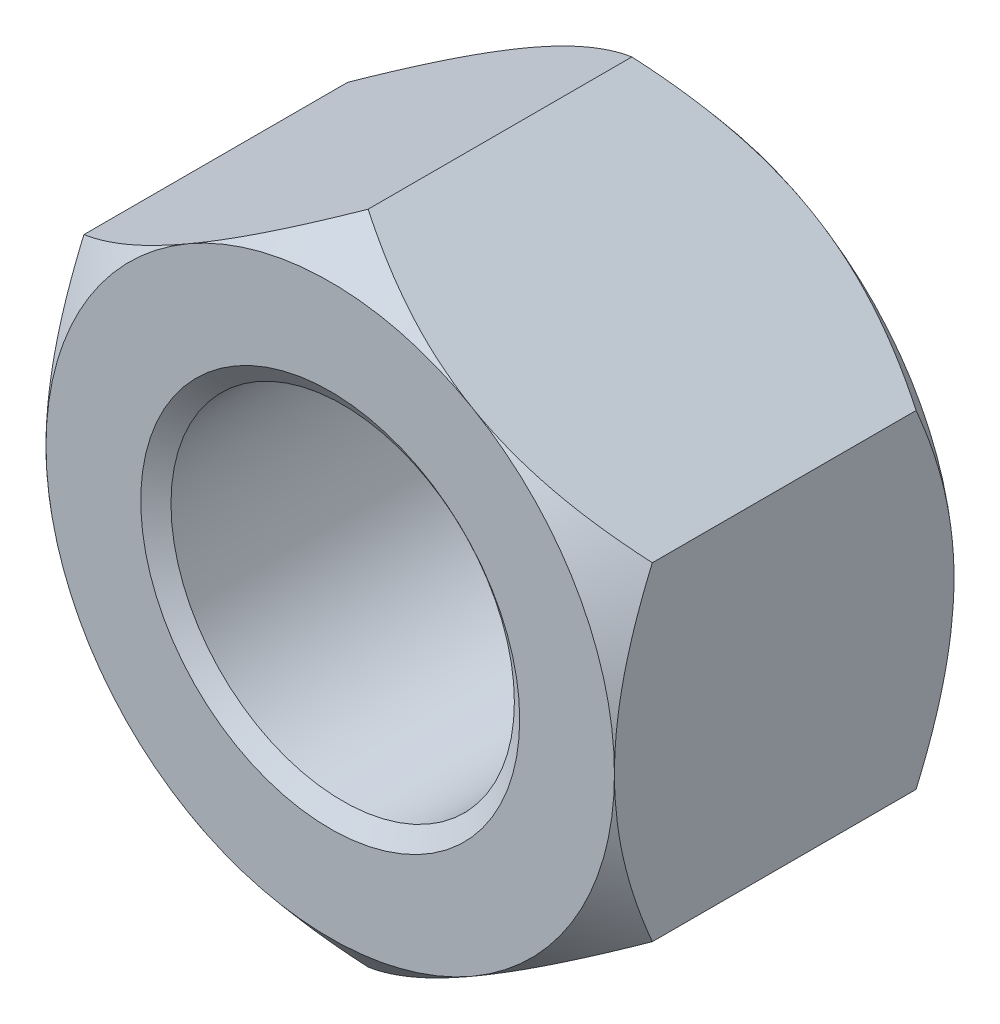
ISO-10303-21;
HEADER;
FILE_DESCRIPTION(('STEP AP214'),'2;1');
FILE_NAME('part.step','',(''),(''),'','','');
FILE_SCHEMA(('AUTOMOTIVE_DESIGN { 1 0 10303 214 1 1 1 1 }'));
ENDSEC;
DATA;
#1=APPLICATION_CONTEXT('core data for automotive mechanical design processes');
#2=APPLICATION_PROTOCOL_DEFINITION('international standard','automotive_design',2000,#1);
#3=PRODUCT_CONTEXT('',#1,'mechanical');
#4=PRODUCT('Part','Part','',(#3));
#5=PRODUCT_RELATED_PRODUCT_CATEGORY('part','',(#4));
#6=PRODUCT_DEFINITION_FORMATION('','',#4);
#7=PRODUCT_DEFINITION_CONTEXT('part definition',#1,'design');
#8=PRODUCT_DEFINITION('design','',#6,#7);
#9=PRODUCT_DEFINITION_SHAPE('','',#8);
#10=(LENGTH_UNIT() NAMED_UNIT(*) SI_UNIT(.MILLI.,.METRE.));
#11=(NAMED_UNIT(*) PLANE_ANGLE_UNIT() SI_UNIT($,.RADIAN.));
#12=(NAMED_UNIT(*) SI_UNIT($,.STERADIAN.) SOLID_ANGLE_UNIT());
#13=UNCERTAINTY_MEASURE_WITH_UNIT(LENGTH_MEASURE(1.E-05),#10,'distance_accuracy_value','');
#14=(GEOMETRIC_REPRESENTATION_CONTEXT(3) GLOBAL_UNCERTAINTY_ASSIGNED_CONTEXT((#13)) GLOBAL_UNIT_ASSIGNED_CONTEXT((#10,
#11,#12)) REPRESENTATION_CONTEXT('',''));
#15=CARTESIAN_POINT('',(0.,0.,0.));
#16=DIRECTION('',(0.,0.,1.));
#17=DIRECTION('',(1.,0.,0.));
#18=AXIS2_PLACEMENT_3D('',#15,#16,#17);
#19=CARTESIAN_POINT('',(0.,0.,-11.3792));
#20=DIRECTION('',(0.,0.,1.));
#21=DIRECTION('',(1.,0.,0.));
#22=AXIS2_PLACEMENT_3D('',#19,#20,#21);
#23=CYLINDRICAL_SURFACE('',#22,5.75437);
#24=CARTESIAN_POINT('',(0.,0.,-0.417064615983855));
#25=DIRECTION('',(0.,0.,1.));
#26=DIRECTION('',(1.,0.,0.));
#27=AXIS2_PLACEMENT_3D('',#24,#25,#26);
#28=CIRCLE('',#27,5.75437);
#29=CARTESIAN_POINT('',(5.75437,0.,-0.417064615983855));
#30=VERTEX_POINT('',#29);
#31=EDGE_CURVE('E180',#30,#30,#28,.F.);
#32=ORIENTED_EDGE('',*,*,#31,.F.);
#33=EDGE_LOOP('',(#32));
#34=FACE_BOUND('',#33,.T.);
#35=CARTESIAN_POINT('',(0.,0.,-10.9367353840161));
#36=DIRECTION('',(0.,0.,-1.));
#37=DIRECTION('',(-1.,0.,0.));
#38=AXIS2_PLACEMENT_3D('',#35,#36,#37);
#39=CIRCLE('',#38,5.75437);
#40=CARTESIAN_POINT('',(-5.75437,0.,-10.9367353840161));
#41=VERTEX_POINT('',#40);
#42=EDGE_CURVE('E44',#41,#41,#39,.F.);
#43=ORIENTED_EDGE('',*,*,#42,.F.);
#44=EDGE_LOOP('',(#43));
#45=FACE_BOUND('',#44,.T.);
#46=ADVANCED_FACE('F39',(#34,#45),#23,.F.);
#47=CARTESIAN_POINT('',(0.,10.9985226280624,-11.3792));
#48=DIRECTION('',(-0.500000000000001,0.866025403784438,0.));
#49=DIRECTION('',(-0.866025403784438,-0.500000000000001,0.));
#50=AXIS2_PLACEMENT_3D('',#47,#48,#49);
#51=PLANE('',#50);
#52=DIRECTION('',(0.,0.,1.));
#53=VECTOR('',#52,1.);
#54=CARTESIAN_POINT('',(-9.525,5.49926131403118,-11.3792));
#55=LINE('',#54,#53);
#56=CARTESIAN_POINT('',(-9.525,5.4992613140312,-10.1092));
#57=VERTEX_POINT('',#56);
#58=CARTESIAN_POINT('',(-9.525,5.49926131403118,-1.26999999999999));
#59=VERTEX_POINT('',#58);
#60=EDGE_CURVE('E170',#57,#59,#55,.T.);
#61=ORIENTED_EDGE('',*,*,#60,.T.);
#62=CARTESIAN_POINT('',(-9.5252,5.49914584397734,-1.27009952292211));
#63=CARTESIAN_POINT('',(-9.33839299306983,5.60699891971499,-1.17716390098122));
#64=CARTESIAN_POINT('',(-9.15032503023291,5.71558000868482,-1.08765771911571));
#65=CARTESIAN_POINT('',(-8.77138097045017,5.9343634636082,-0.916578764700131));
#66=CARTESIAN_POINT('',(-8.58050328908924,6.04456674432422,-0.835010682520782));
#67=CARTESIAN_POINT('',(-8.00174238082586,6.37871451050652,-0.603259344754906));
#68=CARTESIAN_POINT('',(-7.60949175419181,6.60518051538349,-0.466928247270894));
#69=CARTESIAN_POINT('',(-7.01718581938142,6.94714850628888,-0.299102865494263));
#70=CARTESIAN_POINT('',(-6.82089803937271,7.06047530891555,-0.249562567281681));
#71=CARTESIAN_POINT('',(-6.42620814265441,7.28834962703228,-0.163118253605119));
#72=CARTESIAN_POINT('',(-6.22780596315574,7.40289717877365,-0.12621461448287));
#73=CARTESIAN_POINT('',(-5.82988591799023,7.6326364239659,-0.0661339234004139));
#74=CARTESIAN_POINT('',(-5.63037147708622,7.74782614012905,-0.0429267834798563));
#75=CARTESIAN_POINT('',(-5.23048272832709,7.97870201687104,-0.0108096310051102));
#76=CARTESIAN_POINT('',(-5.03010848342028,8.09438814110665,-0.00189858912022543));
#77=CARTESIAN_POINT('',(-4.65728136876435,8.30963997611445,0.00112665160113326));
#78=CARTESIAN_POINT('',(-4.48483807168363,8.40920016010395,-0.00286608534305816));
#79=CARTESIAN_POINT('',(-4.14036520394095,8.6080816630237,-0.0215359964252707));
#80=CARTESIAN_POINT('',(-3.9683356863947,8.7074029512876,-0.0362144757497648));
#81=CARTESIAN_POINT('',(-3.62507786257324,8.90558294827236,-0.0759378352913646));
#82=CARTESIAN_POINT('',(-3.45385009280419,9.00444134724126,-0.100988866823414));
#83=CARTESIAN_POINT('',(-3.11267933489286,9.201416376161,-0.160916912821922));
#84=CARTESIAN_POINT('',(-2.94273654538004,9.29953289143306,-0.195795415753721));
#85=CARTESIAN_POINT('',(-2.43530444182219,9.59249895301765,-0.314178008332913));
#86=CARTESIAN_POINT('',(-2.10018358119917,9.7859810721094,-0.411432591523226));
#87=CARTESIAN_POINT('',(-1.43795461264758,10.1683191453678,-0.636225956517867));
#88=CARTESIAN_POINT('',(-1.11084392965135,10.3571765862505,-0.763754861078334));
#89=CARTESIAN_POINT('',(-0.654927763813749,10.6203999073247,-0.960719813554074));
#90=CARTESIAN_POINT('',(-0.522795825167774,10.6966863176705,-1.02013318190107));
#91=CARTESIAN_POINT('',(-0.260172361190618,10.8483120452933,-1.14251442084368));
#92=CARTESIAN_POINT('',(-0.12967745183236,10.9236533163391,-1.2054725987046));
#93=CARTESIAN_POINT('',(0.000200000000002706,10.9986380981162,-1.27009952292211));
#94=B_SPLINE_CURVE_WITH_KNOTS('',3,(#62,#63,#64,#65,#66,#67,#68,#69,#70,#71,#72,#73,#74,#75,#76,
#77,#78,#79,#80,#81,#82,#83,#84,#85,#86,#87,#88,#89,#90,#91,#92,#93),.UNSPECIFIED.,.F.,.F.,(4,2,
2,2,2,2,2,2,2,2,2,2,2,2,2,4),(0.,0.70453307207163,1.40947993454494,2.82602617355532,
3.52175383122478,4.21750220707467,4.91171644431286,5.60588069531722,6.20307843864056,
6.80034913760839,7.39797454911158,7.99569052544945,9.19102600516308,10.3859720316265,
10.8771348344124,11.3670143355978),.UNSPECIFIED.);
#95=CARTESIAN_POINT('',(-4.76250000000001,8.24889197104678,0.));
#96=VERTEX_POINT('',#95);
#97=EDGE_CURVE('E66',#59,#96,#94,.T.);
#98=ORIENTED_EDGE('',*,*,#97,.T.);
#99=CARTESIAN_POINT('',(0.,10.9985226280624,-1.27));
#100=VERTEX_POINT('',#99);
#101=EDGE_CURVE('E249',#96,#100,#94,.T.);
#102=ORIENTED_EDGE('',*,*,#101,.T.);
#103=DIRECTION('',(0.,0.,1.));
#104=VECTOR('',#103,1.);
#105=CARTESIAN_POINT('',(0.,10.9985226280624,-11.3792));
#106=LINE('',#105,#104);
#107=CARTESIAN_POINT('',(0.,10.9985226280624,-10.1092));
#108=VERTEX_POINT('',#107);
#109=EDGE_CURVE('E155',#108,#100,#106,.T.);
#110=ORIENTED_EDGE('',*,*,#109,.F.);
#111=CARTESIAN_POINT('',(-9.5252,5.49914584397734,-10.1091004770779));
#112=CARTESIAN_POINT('',(-9.33839299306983,5.60699891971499,-10.2020360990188));
#113=CARTESIAN_POINT('',(-9.15032503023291,5.71558000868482,-10.2915422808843));
#114=CARTESIAN_POINT('',(-8.77138097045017,5.9343634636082,-10.4626212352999));
#115=CARTESIAN_POINT('',(-8.58050328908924,6.04456674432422,-10.5441893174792));
#116=CARTESIAN_POINT('',(-8.00174238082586,6.37871451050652,-10.7759406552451));
#117=CARTESIAN_POINT('',(-7.60949175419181,6.60518051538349,-10.9122717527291));
#118=CARTESIAN_POINT('',(-7.01718581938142,6.94714850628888,-11.0800971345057));
#119=CARTESIAN_POINT('',(-6.82089803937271,7.06047530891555,-11.1296374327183));
#120=CARTESIAN_POINT('',(-6.42620814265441,7.28834962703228,-11.2160817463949));
#121=CARTESIAN_POINT('',(-6.22780596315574,7.40289717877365,-11.2529853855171));
#122=CARTESIAN_POINT('',(-5.82988591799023,7.6326364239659,-11.3130660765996));
#123=CARTESIAN_POINT('',(-5.63037147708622,7.74782614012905,-11.3362732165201));
#124=CARTESIAN_POINT('',(-5.23048272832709,7.97870201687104,-11.3683903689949));
#125=CARTESIAN_POINT('',(-5.03010848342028,8.09438814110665,-11.3773014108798));
#126=CARTESIAN_POINT('',(-4.65728136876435,8.30963997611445,-11.3803266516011));
#127=CARTESIAN_POINT('',(-4.48483807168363,8.40920016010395,-11.3763339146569));
#128=CARTESIAN_POINT('',(-4.14036520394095,8.6080816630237,-11.3576640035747));
#129=CARTESIAN_POINT('',(-3.9683356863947,8.7074029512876,-11.3429855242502));
#130=CARTESIAN_POINT('',(-3.62507786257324,8.90558294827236,-11.3032621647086));
#131=CARTESIAN_POINT('',(-3.45385009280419,9.00444134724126,-11.2782111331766));
#132=CARTESIAN_POINT('',(-3.11267933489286,9.201416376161,-11.2182830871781));
#133=CARTESIAN_POINT('',(-2.94273654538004,9.29953289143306,-11.1834045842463));
#134=CARTESIAN_POINT('',(-2.43530444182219,9.59249895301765,-11.0650219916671));
#135=CARTESIAN_POINT('',(-2.10018358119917,9.7859810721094,-10.9677674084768));
#136=CARTESIAN_POINT('',(-1.43795461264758,10.1683191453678,-10.7429740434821));
#137=CARTESIAN_POINT('',(-1.11084392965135,10.3571765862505,-10.6154451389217));
#138=CARTESIAN_POINT('',(-0.65492776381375,10.6203999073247,-10.4184801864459));
#139=CARTESIAN_POINT('',(-0.522795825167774,10.6966863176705,-10.3590668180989));
#140=CARTESIAN_POINT('',(-0.260172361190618,10.8483120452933,-10.2366855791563));
#141=CARTESIAN_POINT('',(-0.12967745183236,10.9236533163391,-10.1737274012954));
#142=CARTESIAN_POINT('',(0.000200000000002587,10.9986380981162,-10.1091004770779));
#143=B_SPLINE_CURVE_WITH_KNOTS('',3,(#111,#112,#113,#114,#115,#116,#117,#118,#119,#120,#121,
#122,#123,#124,#125,#126,#127,#128,#129,#130,#131,#132,#133,#134,#135,#136,#137,#138,#139,#140,
#141,#142),.UNSPECIFIED.,.F.,.F.,(4,2,2,2,2,2,2,2,2,2,2,2,2,2,2,4),(0.,0.70453307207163,
1.40947993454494,2.82602617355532,3.52175383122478,4.21750220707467,4.91171644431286,
5.60588069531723,6.20307843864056,6.80034913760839,7.39797454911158,7.99569052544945,
9.19102600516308,10.3859720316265,10.8771348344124,11.3670143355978),.UNSPECIFIED.);
#144=CARTESIAN_POINT('',(-4.76250000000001,8.24889197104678,-11.3792));
#145=VERTEX_POINT('',#144);
#146=EDGE_CURVE('E173',#145,#108,#143,.T.);
#147=ORIENTED_EDGE('',*,*,#146,.F.);
#148=EDGE_CURVE('E272',#57,#145,#143,.T.);
#149=ORIENTED_EDGE('',*,*,#148,.F.);
#150=EDGE_LOOP('',(#61,#98,#102,#110,#147,#149));
#151=FACE_BOUND('',#150,.T.);
#152=ADVANCED_FACE('F41',(#151),#51,.T.);
#153=CARTESIAN_POINT('',(9.525,5.49926131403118,-11.3792));
#154=DIRECTION('',(0.5,0.866025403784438,0.));
#155=DIRECTION('',(-0.866025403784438,0.5,0.));
#156=AXIS2_PLACEMENT_3D('',#153,#154,#155);
#157=PLANE('',#156);
#158=ORIENTED_EDGE('',*,*,#109,.T.);
#159=CARTESIAN_POINT('',(-0.000200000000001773,10.9986380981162,-1.27009952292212));
#160=CARTESIAN_POINT('',(0.186607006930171,10.8907850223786,-1.17716390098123));
#161=CARTESIAN_POINT('',(0.374674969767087,10.7822039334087,-1.08765771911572));
#162=CARTESIAN_POINT('',(0.753619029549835,10.5634204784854,-0.916578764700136));
#163=CARTESIAN_POINT('',(0.944496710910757,10.4532171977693,-0.835010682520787));
#164=CARTESIAN_POINT('',(1.52325761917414,10.119069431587,-0.60325934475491));
#165=CARTESIAN_POINT('',(1.91550824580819,9.89260342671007,-0.466928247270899));
#166=CARTESIAN_POINT('',(2.50781418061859,9.55063543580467,-0.299102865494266));
#167=CARTESIAN_POINT('',(2.7041019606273,9.43730863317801,-0.249562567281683));
#168=CARTESIAN_POINT('',(3.09879185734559,9.20943431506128,-0.16311825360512));
#169=CARTESIAN_POINT('',(3.29719403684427,9.09488676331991,-0.126214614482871));
#170=CARTESIAN_POINT('',(3.69511408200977,8.86514751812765,-0.0661339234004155));
#171=CARTESIAN_POINT('',(3.89462852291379,8.7499578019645,-0.0429267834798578));
#172=CARTESIAN_POINT('',(4.29451727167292,8.51908192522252,-0.010809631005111));
#173=CARTESIAN_POINT('',(4.49489151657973,8.4033958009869,-0.00189858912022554));
#174=CARTESIAN_POINT('',(4.86771863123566,8.18814396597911,0.00112665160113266));
#175=CARTESIAN_POINT('',(5.04016192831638,8.08858378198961,-0.00286608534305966));
#176=CARTESIAN_POINT('',(5.38463479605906,7.88970227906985,-0.0215359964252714));
#177=CARTESIAN_POINT('',(5.55666431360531,7.79038099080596,-0.0362144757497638));
#178=CARTESIAN_POINT('',(5.89992213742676,7.5922009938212,-0.0759378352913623));
#179=CARTESIAN_POINT('',(6.07114990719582,7.4933425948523,-0.100988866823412));
#180=CARTESIAN_POINT('',(6.41232066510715,7.29636756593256,-0.160916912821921));
#181=CARTESIAN_POINT('',(6.58226345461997,7.19825105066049,-0.195795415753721));
#182=CARTESIAN_POINT('',(7.08969555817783,6.90528498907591,-0.314178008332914));
#183=CARTESIAN_POINT('',(7.42481641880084,6.71180286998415,-0.411432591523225));
#184=CARTESIAN_POINT('',(8.08704538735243,6.32946479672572,-0.636225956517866));
#185=CARTESIAN_POINT('',(8.41415607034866,6.14060735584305,-0.763754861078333));
#186=CARTESIAN_POINT('',(8.87007223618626,5.87738403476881,-0.960719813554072));
#187=CARTESIAN_POINT('',(9.00220417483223,5.80109762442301,-1.02013318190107));
#188=CARTESIAN_POINT('',(9.26482763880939,5.64947189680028,-1.14251442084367));
#189=CARTESIAN_POINT('',(9.39532254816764,5.57413062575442,-1.20547259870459));
#190=CARTESIAN_POINT('',(9.52520000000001,5.49914584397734,-1.2700995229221));
#191=B_SPLINE_CURVE_WITH_KNOTS('',3,(#159,#160,#161,#162,#163,#164,#165,#166,#167,#168,#169,
#170,#171,#172,#173,#174,#175,#176,#177,#178,#179,#180,#181,#182,#183,#184,#185,#186,#187,#188,
#189,#190),.UNSPECIFIED.,.F.,.F.,(4,2,2,2,2,2,2,2,2,2,2,2,2,2,2,4),(0.,0.704533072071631,
1.40947993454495,2.82602617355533,3.52175383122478,4.21750220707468,4.91171644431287,
5.60588069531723,6.20307843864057,6.8003491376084,7.39797454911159,7.99569052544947,
9.19102600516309,10.3859720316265,10.8771348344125,11.3670143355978),.UNSPECIFIED.);
#192=CARTESIAN_POINT('',(4.76250000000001,8.24889197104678,0.));
#193=VERTEX_POINT('',#192);
#194=EDGE_CURVE('E148',#100,#193,#191,.T.);
#195=ORIENTED_EDGE('',*,*,#194,.T.);
#196=CARTESIAN_POINT('',(9.525,5.4992613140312,-1.27));
#197=VERTEX_POINT('',#196);
#198=EDGE_CURVE('E134',#193,#197,#191,.T.);
#199=ORIENTED_EDGE('',*,*,#198,.T.);
#200=DIRECTION('',(0.,0.,1.));
#201=VECTOR('',#200,1.);
#202=CARTESIAN_POINT('',(9.525,5.49926131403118,-11.3792));
#203=LINE('',#202,#201);
#204=CARTESIAN_POINT('',(9.525,5.4992613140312,-10.1092));
#205=VERTEX_POINT('',#204);
#206=EDGE_CURVE('E147',#205,#197,#203,.T.);
#207=ORIENTED_EDGE('',*,*,#206,.F.);
#208=CARTESIAN_POINT('',(-0.000200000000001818,10.9986380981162,-10.1091004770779));
#209=CARTESIAN_POINT('',(0.186607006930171,10.8907850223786,-10.2020360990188));
#210=CARTESIAN_POINT('',(0.374674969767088,10.7822039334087,-10.2915422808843));
#211=CARTESIAN_POINT('',(0.753619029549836,10.5634204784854,-10.4626212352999));
#212=CARTESIAN_POINT('',(0.944496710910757,10.4532171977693,-10.5441893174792));
#213=CARTESIAN_POINT('',(1.52325761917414,10.119069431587,-10.7759406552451));
#214=CARTESIAN_POINT('',(1.91550824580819,9.89260342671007,-10.9122717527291));
#215=CARTESIAN_POINT('',(2.50781418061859,9.55063543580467,-11.0800971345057));
#216=CARTESIAN_POINT('',(2.7041019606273,9.43730863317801,-11.1296374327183));
#217=CARTESIAN_POINT('',(3.0987918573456,9.20943431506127,-11.2160817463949));
#218=CARTESIAN_POINT('',(3.29719403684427,9.09488676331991,-11.2529853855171));
#219=CARTESIAN_POINT('',(3.69511408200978,8.86514751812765,-11.3130660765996));
#220=CARTESIAN_POINT('',(3.89462852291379,8.7499578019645,-11.3362732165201));
#221=CARTESIAN_POINT('',(4.29451727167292,8.51908192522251,-11.3683903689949));
#222=CARTESIAN_POINT('',(4.49489151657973,8.4033958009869,-11.3773014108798));
#223=CARTESIAN_POINT('',(4.86771863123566,8.18814396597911,-11.3803266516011));
#224=CARTESIAN_POINT('',(5.04016192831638,8.08858378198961,-11.3763339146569));
#225=CARTESIAN_POINT('',(5.38463479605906,7.88970227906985,-11.3576640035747));
#226=CARTESIAN_POINT('',(5.55666431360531,7.79038099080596,-11.3429855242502));
#227=CARTESIAN_POINT('',(5.89992213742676,7.5922009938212,-11.3032621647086));
#228=CARTESIAN_POINT('',(6.07114990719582,7.4933425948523,-11.2782111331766));
#229=CARTESIAN_POINT('',(6.41232066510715,7.29636756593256,-11.2182830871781));
#230=CARTESIAN_POINT('',(6.58226345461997,7.19825105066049,-11.1834045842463));
#231=CARTESIAN_POINT('',(7.08969555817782,6.90528498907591,-11.0650219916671));
#232=CARTESIAN_POINT('',(7.42481641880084,6.71180286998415,-10.9677674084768));
#233=CARTESIAN_POINT('',(8.08704538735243,6.32946479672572,-10.7429740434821));
#234=CARTESIAN_POINT('',(8.41415607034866,6.14060735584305,-10.6154451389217));
#235=CARTESIAN_POINT('',(8.87007223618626,5.87738403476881,-10.4184801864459));
#236=CARTESIAN_POINT('',(9.00220417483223,5.80109762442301,-10.3590668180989));
#237=CARTESIAN_POINT('',(9.26482763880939,5.64947189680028,-10.2366855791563));
#238=CARTESIAN_POINT('',(9.39532254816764,5.57413062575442,-10.1737274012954));
#239=CARTESIAN_POINT('',(9.52520000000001,5.49914584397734,-10.1091004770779));
#240=B_SPLINE_CURVE_WITH_KNOTS('',3,(#208,#209,#210,#211,#212,#213,#214,#215,#216,#217,#218,
#219,#220,#221,#222,#223,#224,#225,#226,#227,#228,#229,#230,#231,#232,#233,#234,#235,#236,#237,
#238,#239),.UNSPECIFIED.,.F.,.F.,(4,2,2,2,2,2,2,2,2,2,2,2,2,2,2,4),(0.,0.704533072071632,
1.40947993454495,2.82602617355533,3.52175383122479,4.21750220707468,4.91171644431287,
5.60588069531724,6.20307843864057,6.8003491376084,7.39797454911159,7.99569052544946,
9.19102600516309,10.3859720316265,10.8771348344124,11.3670143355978),.UNSPECIFIED.);
#241=CARTESIAN_POINT('',(4.76250000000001,8.24889197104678,-11.3792));
#242=VERTEX_POINT('',#241);
#243=EDGE_CURVE('E265',#242,#205,#240,.T.);
#244=ORIENTED_EDGE('',*,*,#243,.F.);
#245=EDGE_CURVE('E271',#108,#242,#240,.T.);
#246=ORIENTED_EDGE('',*,*,#245,.F.);
#247=EDGE_LOOP('',(#158,#195,#199,#207,#244,#246));
#248=FACE_BOUND('',#247,.T.);
#249=ADVANCED_FACE('F145',(#248),#157,.T.);
#250=CARTESIAN_POINT('',(9.525,5.49926131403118,-11.3792));
#251=DIRECTION('',(-1.,0.,0.));
#252=DIRECTION('',(0.,0.,1.));
#253=AXIS2_PLACEMENT_3D('',#250,#251,#252);
#254=PLANE('',#253);
#255=CARTESIAN_POINT('',(9.525,-12.1729537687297,-5.11232714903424));
#256=CARTESIAN_POINT('',(9.525,-11.8649823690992,-4.90333164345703));
#257=CARTESIAN_POINT('',(9.525,-11.5556402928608,-4.69632320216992));
#258=CARTESIAN_POINT('',(9.525,-10.9336249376,-4.28722712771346));
#259=CARTESIAN_POINT('',(9.525,-10.620950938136,-4.08514059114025));
#260=CARTESIAN_POINT('',(9.525,-9.98958648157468,-3.68551608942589));
#261=CARTESIAN_POINT('',(9.525,-9.67086908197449,-3.48802054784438));
#262=CARTESIAN_POINT('',(9.525,-9.02896268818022,-3.1004593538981));
#263=CARTESIAN_POINT('',(9.525,-8.70577397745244,-2.9103932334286));
#264=CARTESIAN_POINT('',(9.525,-8.03647991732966,-2.52935869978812));
#265=CARTESIAN_POINT('',(9.525,-7.69008249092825,-2.33890069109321));
#266=CARTESIAN_POINT('',(9.525,-6.99042937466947,-1.97081267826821));
#267=CARTESIAN_POINT('',(9.525,-6.63717268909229,-1.79318455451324));
#268=CARTESIAN_POINT('',(9.525,-5.92380495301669,-1.45474902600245));
#269=CARTESIAN_POINT('',(9.525,-5.5637151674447,-1.29389716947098));
#270=CARTESIAN_POINT('',(9.525,-4.83501678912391,-0.992987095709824));
#271=CARTESIAN_POINT('',(9.525,-4.46641178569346,-0.852920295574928));
#272=CARTESIAN_POINT('',(9.525,-3.73066559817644,-0.602553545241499));
#273=CARTESIAN_POINT('',(9.525,-3.36377431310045,-0.491527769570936));
#274=CARTESIAN_POINT('',(9.525,-2.62192554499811,-0.299895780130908));
#275=CARTESIAN_POINT('',(9.525,-2.24696840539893,-0.21928827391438));
#276=CARTESIAN_POINT('',(9.525,-1.6836491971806,-0.125781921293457));
#277=CARTESIAN_POINT('',(9.525,-1.49748475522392,-0.0993054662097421));
#278=CARTESIAN_POINT('',(9.525,-1.12409700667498,-0.055436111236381));
#279=CARTESIAN_POINT('',(9.525,-0.936873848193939,-0.0380419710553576));
#280=CARTESIAN_POINT('',(9.525,-0.561792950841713,-0.0126876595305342));
#281=CARTESIAN_POINT('',(9.525,-0.373935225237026,-0.00472729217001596));
#282=CARTESIAN_POINT('',(9.525,0.00194119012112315,0.00159723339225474));
#283=CARTESIAN_POINT('',(9.525,0.18995987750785,-3.84696514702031E-05));
#284=CARTESIAN_POINT('',(9.525,0.553098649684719,-0.0124433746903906));
#285=CARTESIAN_POINT('',(9.525,0.728240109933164,-0.0225941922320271));
#286=CARTESIAN_POINT('',(9.525,1.07786699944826,-0.0510326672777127));
#287=CARTESIAN_POINT('',(9.525,1.25235236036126,-0.0693211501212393));
#288=CARTESIAN_POINT('',(9.525,1.77426958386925,-0.135954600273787));
#289=CARTESIAN_POINT('',(9.525,2.12024686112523,-0.196070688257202));
#290=CARTESIAN_POINT('',(9.525,2.81322919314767,-0.345583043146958));
#291=CARTESIAN_POINT('',(9.525,3.16010553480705,-0.435563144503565));
#292=CARTESIAN_POINT('',(9.525,3.67485348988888,-0.588704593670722));
#293=CARTESIAN_POINT('',(9.525,3.84550254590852,-0.642778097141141));
#294=CARTESIAN_POINT('',(9.525,4.18495630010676,-0.75642537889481));
#295=CARTESIAN_POINT('',(9.525,4.35376104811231,-0.815999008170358));
#296=CARTESIAN_POINT('',(9.525,4.82895878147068,-0.991635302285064));
#297=CARTESIAN_POINT('',(9.525,5.13320334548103,-1.1135266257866));
#298=CARTESIAN_POINT('',(9.525,5.73590222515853,-1.37094918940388));
#299=CARTESIAN_POINT('',(9.525,6.0343548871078,-1.50648425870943));
#300=CARTESIAN_POINT('',(9.525,6.62624728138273,-1.78884588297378));
#301=CARTESIAN_POINT('',(9.525,6.91968113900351,-1.93568469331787));
#302=CARTESIAN_POINT('',(9.525,7.5017477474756,-2.23848527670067));
#303=CARTESIAN_POINT('',(9.525,7.79038090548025,-2.39444627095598));
#304=CARTESIAN_POINT('',(9.525,8.36517466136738,-2.71484848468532));
#305=CARTESIAN_POINT('',(9.525,8.65130978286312,-2.87933524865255));
#306=CARTESIAN_POINT('',(9.525,9.21986425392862,-3.2146026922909));
#307=CARTESIAN_POINT('',(9.525,9.50228353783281,-3.38538348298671));
#308=CARTESIAN_POINT('',(9.525,10.0637168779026,-3.73208658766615));
#309=CARTESIAN_POINT('',(9.525,10.3427327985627,-3.90800588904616));
#310=CARTESIAN_POINT('',(9.525,10.8979424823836,-4.26424810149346));
#311=CARTESIAN_POINT('',(9.525,11.1741361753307,-4.44457112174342));
#312=CARTESIAN_POINT('',(9.525,11.9446950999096,-4.95510532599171));
#313=CARTESIAN_POINT('',(9.525,12.4362969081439,-5.28948772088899));
#314=CARTESIAN_POINT('',(9.525,13.4132639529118,-5.96734156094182));
#315=CARTESIAN_POINT('',(9.525,13.8986282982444,-6.31081428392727));
#316=CARTESIAN_POINT('',(9.525,14.8579504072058,-7.00015458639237));
#317=CARTESIAN_POINT('',(9.525,15.3319741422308,-7.34593049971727));
#318=CARTESIAN_POINT('',(9.525,16.0399753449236,-7.86856531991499));
#319=CARTESIAN_POINT('',(9.525,16.2754400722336,-8.04341612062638));
#320=CARTESIAN_POINT('',(9.525,16.7454692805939,-8.39431892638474));
#321=CARTESIAN_POINT('',(9.525,16.9800337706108,-8.57037091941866));
#322=CARTESIAN_POINT('',(9.525,17.2141957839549,-8.74695694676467));
#323=B_SPLINE_CURVE_WITH_KNOTS('',3,(#255,#256,#257,#258,#259,#260,#261,#262,#263,#264,#265,
#266,#267,#268,#269,#270,#271,#272,#273,#274,#275,#276,#277,#278,#279,#280,#281,#282,#283,#284,
#285,#286,#287,#288,#289,#290,#291,#292,#293,#294,#295,#296,#297,#298,#299,#300,#301,#302,#303,
#304,#305,#306,#307,#308,#309,#310,#311,#312,#313,#314,#315,#316,#317,#318,#319,#320,#321,#322),
.UNSPECIFIED.,.F.,.F.,(4,2,2,2,2,2,2,2,2,2,2,2,2,2,2,2,2,2,2,2,2,2,2,2,2,2,2,2,2,2,2,2,2,4),(0.,
1.11658997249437,2.23342648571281,3.35818373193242,4.48286999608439,5.66856920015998,
6.85444183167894,8.03708787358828,9.21924419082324,10.368183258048,11.5170735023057,
12.081000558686,12.6448505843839,13.2086888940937,13.7725190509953,14.2986270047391,
14.8247883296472,15.8768589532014,16.9508446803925,17.4878002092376,18.0247411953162,
19.0075579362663,19.9906512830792,20.974825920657,21.958916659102,22.9489533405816,
23.9390074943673,24.9284924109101,25.9180018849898,27.7014855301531,29.4852212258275,
31.2453793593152,32.1252332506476,33.0050783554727),.UNSPECIFIED.);
#324=CARTESIAN_POINT('',(9.525,-5.49926131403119,-1.27));
#325=VERTEX_POINT('',#324);
#326=CARTESIAN_POINT('',(9.525,0.,0.));
#327=VERTEX_POINT('',#326);
#328=EDGE_CURVE('E140',#325,#327,#323,.T.);
#329=ORIENTED_EDGE('',*,*,#328,.F.);
#330=DIRECTION('',(0.,0.,1.));
#331=VECTOR('',#330,1.);
#332=CARTESIAN_POINT('',(9.525,-5.49926131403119,-11.3792));
#333=LINE('',#332,#331);
#334=CARTESIAN_POINT('',(9.525,-5.49926131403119,-10.1092));
#335=VERTEX_POINT('',#334);
#336=EDGE_CURVE('E156',#335,#325,#333,.T.);
#337=ORIENTED_EDGE('',*,*,#336,.F.);
#338=CARTESIAN_POINT('',(9.525,-12.1729537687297,-6.26687285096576));
#339=CARTESIAN_POINT('',(9.525,-11.8649823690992,-6.47586835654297));
#340=CARTESIAN_POINT('',(9.525,-11.5556402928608,-6.68287679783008));
#341=CARTESIAN_POINT('',(9.525,-10.9336249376,-7.09197287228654));
#342=CARTESIAN_POINT('',(9.525,-10.620950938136,-7.29405940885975));
#343=CARTESIAN_POINT('',(9.525,-9.98958648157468,-7.69368391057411));
#344=CARTESIAN_POINT('',(9.525,-9.67086908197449,-7.89117945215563));
#345=CARTESIAN_POINT('',(9.525,-9.02896268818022,-8.2787406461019));
#346=CARTESIAN_POINT('',(9.525,-8.70577397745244,-8.4688067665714));
#347=CARTESIAN_POINT('',(9.525,-8.03647991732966,-8.84984130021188));
#348=CARTESIAN_POINT('',(9.525,-7.69008249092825,-9.04029930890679));
#349=CARTESIAN_POINT('',(9.525,-6.99042937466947,-9.40838732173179));
#350=CARTESIAN_POINT('',(9.525,-6.63717268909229,-9.58601544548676));
#351=CARTESIAN_POINT('',(9.525,-5.92380495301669,-9.92445097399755));
#352=CARTESIAN_POINT('',(9.525,-5.5637151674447,-10.085302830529));
#353=CARTESIAN_POINT('',(9.525,-4.83501678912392,-10.3862129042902));
#354=CARTESIAN_POINT('',(9.525,-4.46641178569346,-10.5262797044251));
#355=CARTESIAN_POINT('',(9.525,-3.73066559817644,-10.7766464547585));
#356=CARTESIAN_POINT('',(9.525,-3.36377431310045,-10.8876722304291));
#357=CARTESIAN_POINT('',(9.525,-2.62192554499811,-11.0793042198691));
#358=CARTESIAN_POINT('',(9.525,-2.24696840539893,-11.1599117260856));
#359=CARTESIAN_POINT('',(9.525,-1.6836491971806,-11.2534180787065));
#360=CARTESIAN_POINT('',(9.525,-1.49748475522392,-11.2798945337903));
#361=CARTESIAN_POINT('',(9.525,-1.12409700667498,-11.3237638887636));
#362=CARTESIAN_POINT('',(9.525,-0.936873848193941,-11.3411580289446));
#363=CARTESIAN_POINT('',(9.525,-0.561792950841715,-11.3665123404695));
#364=CARTESIAN_POINT('',(9.525,-0.373935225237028,-11.37447270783));
#365=CARTESIAN_POINT('',(9.525,0.00194119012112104,-11.3807972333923));
#366=CARTESIAN_POINT('',(9.525,0.189959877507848,-11.3791615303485));
#367=CARTESIAN_POINT('',(9.525,0.553098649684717,-11.3667566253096));
#368=CARTESIAN_POINT('',(9.525,0.728240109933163,-11.356605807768));
#369=CARTESIAN_POINT('',(9.525,1.07786699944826,-11.3281673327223));
#370=CARTESIAN_POINT('',(9.525,1.25235236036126,-11.3098788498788));
#371=CARTESIAN_POINT('',(9.525,1.77426958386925,-11.2432453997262));
#372=CARTESIAN_POINT('',(9.525,2.12024686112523,-11.1831293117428));
#373=CARTESIAN_POINT('',(9.525,2.81322919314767,-11.033616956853));
#374=CARTESIAN_POINT('',(9.525,3.16010553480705,-10.9436368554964));
#375=CARTESIAN_POINT('',(9.525,3.67485348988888,-10.7904954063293));
#376=CARTESIAN_POINT('',(9.525,3.84550254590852,-10.7364219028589));
#377=CARTESIAN_POINT('',(9.525,4.18495630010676,-10.6227746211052));
#378=CARTESIAN_POINT('',(9.525,4.35376104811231,-10.5632009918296));
#379=CARTESIAN_POINT('',(9.525,4.82895878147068,-10.3875646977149));
#380=CARTESIAN_POINT('',(9.525,5.13320334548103,-10.2656733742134));
#381=CARTESIAN_POINT('',(9.525,5.73590222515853,-10.0082508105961));
#382=CARTESIAN_POINT('',(9.525,6.0343548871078,-9.87271574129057));
#383=CARTESIAN_POINT('',(9.525,6.62624728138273,-9.59035411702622));
#384=CARTESIAN_POINT('',(9.525,6.91968113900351,-9.44351530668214));
#385=CARTESIAN_POINT('',(9.525,7.5017477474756,-9.14071472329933));
#386=CARTESIAN_POINT('',(9.525,7.79038090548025,-8.98475372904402));
#387=CARTESIAN_POINT('',(9.525,8.36517466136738,-8.66435151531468));
#388=CARTESIAN_POINT('',(9.525,8.65130978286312,-8.49986475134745));
#389=CARTESIAN_POINT('',(9.525,9.21986425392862,-8.1645973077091));
#390=CARTESIAN_POINT('',(9.525,9.50228353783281,-7.99381651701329));
#391=CARTESIAN_POINT('',(9.525,10.0637168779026,-7.64711341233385));
#392=CARTESIAN_POINT('',(9.525,10.3427327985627,-7.47119411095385));
#393=CARTESIAN_POINT('',(9.525,10.8979424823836,-7.11495189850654));
#394=CARTESIAN_POINT('',(9.525,11.1741361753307,-6.93462887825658));
#395=CARTESIAN_POINT('',(9.525,11.9446950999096,-6.42409467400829));
#396=CARTESIAN_POINT('',(9.525,12.4362969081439,-6.08971227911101));
#397=CARTESIAN_POINT('',(9.525,13.4132639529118,-5.41185843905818));
#398=CARTESIAN_POINT('',(9.525,13.8986282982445,-5.06838571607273));
#399=CARTESIAN_POINT('',(9.525,14.8579504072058,-4.37904541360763));
#400=CARTESIAN_POINT('',(9.525,15.3319741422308,-4.03326950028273));
#401=CARTESIAN_POINT('',(9.525,16.0399753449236,-3.51063468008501));
#402=CARTESIAN_POINT('',(9.525,16.2754400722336,-3.33578387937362));
#403=CARTESIAN_POINT('',(9.525,16.7454692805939,-2.98488107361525));
#404=CARTESIAN_POINT('',(9.525,16.9800337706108,-2.80882908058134));
#405=CARTESIAN_POINT('',(9.525,17.2141957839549,-2.63224305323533));
#406=B_SPLINE_CURVE_WITH_KNOTS('',3,(#338,#339,#340,#341,#342,#343,#344,#345,#346,#347,#348,
#349,#350,#351,#352,#353,#354,#355,#356,#357,#358,#359,#360,#361,#362,#363,#364,#365,#366,#367,
#368,#369,#370,#371,#372,#373,#374,#375,#376,#377,#378,#379,#380,#381,#382,#383,#384,#385,#386,
#387,#388,#389,#390,#391,#392,#393,#394,#395,#396,#397,#398,#399,#400,#401,#402,#403,#404,#405),
.UNSPECIFIED.,.F.,.F.,(4,2,2,2,2,2,2,2,2,2,2,2,2,2,2,2,2,2,2,2,2,2,2,2,2,2,2,2,2,2,2,2,2,4),(0.,
1.11658997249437,2.23342648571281,3.35818373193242,4.48286999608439,5.66856920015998,
6.85444183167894,8.03708787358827,9.21924419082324,10.368183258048,11.5170735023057,
12.081000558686,12.6448505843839,13.2086888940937,13.7725190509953,14.2986270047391,
14.8247883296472,15.8768589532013,16.9508446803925,17.4878002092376,18.0247411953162,
19.0075579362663,19.9906512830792,20.974825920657,21.958916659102,22.9489533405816,
23.9390074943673,24.9284924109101,25.9180018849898,27.7014855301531,29.4852212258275,
31.2453793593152,32.1252332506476,33.0050783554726),.UNSPECIFIED.);
#407=CARTESIAN_POINT('',(9.525,0.,-11.3792));
#408=VERTEX_POINT('',#407);
#409=EDGE_CURVE('E278',#335,#408,#406,.T.);
#410=ORIENTED_EDGE('',*,*,#409,.T.);
#411=EDGE_CURVE('E154',#408,#205,#406,.T.);
#412=ORIENTED_EDGE('',*,*,#411,.T.);
#413=ORIENTED_EDGE('',*,*,#206,.T.);
#414=EDGE_CURVE('E131',#327,#197,#323,.T.);
#415=ORIENTED_EDGE('',*,*,#414,.F.);
#416=EDGE_LOOP('',(#329,#337,#410,#412,#413,#415));
#417=FACE_BOUND('',#416,.T.);
#418=ADVANCED_FACE('F151',(#417),#254,.F.);
#419=CARTESIAN_POINT('',(0.,-10.9985226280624,-11.3792));
#420=DIRECTION('',(0.500000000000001,-0.866025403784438,0.));
#421=DIRECTION('',(0.866025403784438,0.500000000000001,0.));
#422=AXIS2_PLACEMENT_3D('',#419,#420,#421);
#423=PLANE('',#422);
#424=ORIENTED_EDGE('',*,*,#336,.T.);
#425=CARTESIAN_POINT('',(9.5252,-5.49914584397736,-1.27009952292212));
#426=CARTESIAN_POINT('',(9.33839299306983,-5.606998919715,-1.17716390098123));
#427=CARTESIAN_POINT('',(9.15032503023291,-5.71558000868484,-1.08765771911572));
#428=CARTESIAN_POINT('',(8.77138097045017,-5.93436346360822,-0.916578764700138));
#429=CARTESIAN_POINT('',(8.58050328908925,-6.04456674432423,-0.835010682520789));
#430=CARTESIAN_POINT('',(8.00174238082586,-6.37871451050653,-0.603259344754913));
#431=CARTESIAN_POINT('',(7.60949175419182,-6.6051805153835,-0.466928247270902));
#432=CARTESIAN_POINT('',(7.01718581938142,-6.94714850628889,-0.299102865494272));
#433=CARTESIAN_POINT('',(6.82089803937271,-7.06047530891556,-0.24956256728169));
#434=CARTESIAN_POINT('',(6.42620814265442,-7.28834962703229,-0.16311825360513));
#435=CARTESIAN_POINT('',(6.22780596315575,-7.40289717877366,-0.126214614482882));
#436=CARTESIAN_POINT('',(5.82988591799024,-7.63263642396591,-0.0661339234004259));
#437=CARTESIAN_POINT('',(5.63037147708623,-7.74782614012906,-0.0429267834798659));
#438=CARTESIAN_POINT('',(5.2304827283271,-7.97870201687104,-0.0108096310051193));
#439=CARTESIAN_POINT('',(5.03010848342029,-8.09438814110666,-0.00189858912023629));
#440=CARTESIAN_POINT('',(4.65728136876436,-8.30963997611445,0.00112665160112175));
#441=CARTESIAN_POINT('',(4.48483807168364,-8.40920016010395,-0.00286608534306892));
#442=CARTESIAN_POINT('',(4.14036520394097,-8.60808166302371,-0.0215359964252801));
#443=CARTESIAN_POINT('',(3.96833568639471,-8.7074029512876,-0.0362144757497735));
#444=CARTESIAN_POINT('',(3.62507786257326,-8.90558294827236,-0.0759378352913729));
#445=CARTESIAN_POINT('',(3.45385009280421,-9.00444134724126,-0.100988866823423));
#446=CARTESIAN_POINT('',(3.11267933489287,-9.201416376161,-0.16091691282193));
#447=CARTESIAN_POINT('',(2.94273654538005,-9.29953289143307,-0.195795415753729));
#448=CARTESIAN_POINT('',(2.4353044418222,-9.59249895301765,-0.31417800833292));
#449=CARTESIAN_POINT('',(2.10018358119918,-9.78598107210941,-0.411432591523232));
#450=CARTESIAN_POINT('',(1.4379546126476,-10.1683191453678,-0.636225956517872));
#451=CARTESIAN_POINT('',(1.11084392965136,-10.3571765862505,-0.763754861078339));
#452=CARTESIAN_POINT('',(0.654927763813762,-10.6203999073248,-0.96071981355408));
#453=CARTESIAN_POINT('',(0.522795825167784,-10.6966863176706,-1.02013318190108));
#454=CARTESIAN_POINT('',(0.260172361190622,-10.8483120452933,-1.14251442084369));
#455=CARTESIAN_POINT('',(0.129677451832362,-10.9236533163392,-1.20547259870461));
#456=CARTESIAN_POINT('',(-0.000200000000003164,-10.9986380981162,-1.27009952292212));
#457=B_SPLINE_CURVE_WITH_KNOTS('',3,(#425,#426,#427,#428,#429,#430,#431,#432,#433,#434,#435,
#436,#437,#438,#439,#440,#441,#442,#443,#444,#445,#446,#447,#448,#449,#450,#451,#452,#453,#454,
#455,#456),.UNSPECIFIED.,.F.,.F.,(4,2,2,2,2,2,2,2,2,2,2,2,2,2,2,4),(0.,0.704533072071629,
1.40947993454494,2.82602617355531,3.52175383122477,4.21750220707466,4.91171644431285,
5.60588069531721,6.20307843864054,6.80034913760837,7.39797454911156,7.99569052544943,
9.19102600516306,10.3859720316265,10.8771348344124,11.3670143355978),.UNSPECIFIED.);
#458=CARTESIAN_POINT('',(4.76250000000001,-8.24889197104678,0.));
#459=VERTEX_POINT('',#458);
#460=EDGE_CURVE('E501',#325,#459,#457,.T.);
#461=ORIENTED_EDGE('',*,*,#460,.T.);
#462=CARTESIAN_POINT('',(0.,-10.9985226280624,-1.27));
#463=VERTEX_POINT('',#462);
#464=EDGE_CURVE('E233',#459,#463,#457,.T.);
#465=ORIENTED_EDGE('',*,*,#464,.T.);
#466=DIRECTION('',(0.,0.,1.));
#467=VECTOR('',#466,1.);
#468=CARTESIAN_POINT('',(0.,-10.9985226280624,-11.3792));
#469=LINE('',#468,#467);
#470=CARTESIAN_POINT('',(0.,-10.9985226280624,-10.1092));
#471=VERTEX_POINT('',#470);
#472=EDGE_CURVE('E161',#471,#463,#469,.T.);
#473=ORIENTED_EDGE('',*,*,#472,.F.);
#474=CARTESIAN_POINT('',(9.5252,-5.49914584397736,-10.1091004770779));
#475=CARTESIAN_POINT('',(9.33839299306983,-5.606998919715,-10.2020360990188));
#476=CARTESIAN_POINT('',(9.15032503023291,-5.71558000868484,-10.2915422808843));
#477=CARTESIAN_POINT('',(8.77138097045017,-5.93436346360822,-10.4626212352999));
#478=CARTESIAN_POINT('',(8.58050328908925,-6.04456674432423,-10.5441893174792));
#479=CARTESIAN_POINT('',(8.00174238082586,-6.37871451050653,-10.7759406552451));
#480=CARTESIAN_POINT('',(7.60949175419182,-6.6051805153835,-10.9122717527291));
#481=CARTESIAN_POINT('',(7.01718581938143,-6.94714850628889,-11.0800971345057));
#482=CARTESIAN_POINT('',(6.82089803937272,-7.06047530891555,-11.1296374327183));
#483=CARTESIAN_POINT('',(6.42620814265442,-7.28834962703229,-11.2160817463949));
#484=CARTESIAN_POINT('',(6.22780596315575,-7.40289717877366,-11.2529853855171));
#485=CARTESIAN_POINT('',(5.82988591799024,-7.63263642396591,-11.3130660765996));
#486=CARTESIAN_POINT('',(5.63037147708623,-7.74782614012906,-11.3362732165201));
#487=CARTESIAN_POINT('',(5.2304827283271,-7.97870201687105,-11.3683903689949));
#488=CARTESIAN_POINT('',(5.03010848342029,-8.09438814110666,-11.3773014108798));
#489=CARTESIAN_POINT('',(4.65728136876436,-8.30963997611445,-11.3803266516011));
#490=CARTESIAN_POINT('',(4.48483807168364,-8.40920016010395,-11.3763339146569));
#491=CARTESIAN_POINT('',(4.14036520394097,-8.60808166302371,-11.3576640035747));
#492=CARTESIAN_POINT('',(3.96833568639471,-8.7074029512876,-11.3429855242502));
#493=CARTESIAN_POINT('',(3.62507786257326,-8.90558294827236,-11.3032621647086));
#494=CARTESIAN_POINT('',(3.45385009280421,-9.00444134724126,-11.2782111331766));
#495=CARTESIAN_POINT('',(3.11267933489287,-9.201416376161,-11.2182830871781));
#496=CARTESIAN_POINT('',(2.94273654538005,-9.29953289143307,-11.1834045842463));
#497=CARTESIAN_POINT('',(2.4353044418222,-9.59249895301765,-11.0650219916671));
#498=CARTESIAN_POINT('',(2.10018358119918,-9.78598107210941,-10.9677674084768));
#499=CARTESIAN_POINT('',(1.43795461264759,-10.1683191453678,-10.7429740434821));
#500=CARTESIAN_POINT('',(1.11084392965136,-10.3571765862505,-10.6154451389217));
#501=CARTESIAN_POINT('',(0.654927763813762,-10.6203999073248,-10.4184801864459));
#502=CARTESIAN_POINT('',(0.522795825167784,-10.6966863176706,-10.3590668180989));
#503=CARTESIAN_POINT('',(0.260172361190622,-10.8483120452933,-10.2366855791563));
#504=CARTESIAN_POINT('',(0.129677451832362,-10.9236533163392,-10.1737274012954));
#505=CARTESIAN_POINT('',(-0.00020000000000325,-10.9986380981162,-10.1091004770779));
#506=B_SPLINE_CURVE_WITH_KNOTS('',3,(#474,#475,#476,#477,#478,#479,#480,#481,#482,#483,#484,
#485,#486,#487,#488,#489,#490,#491,#492,#493,#494,#495,#496,#497,#498,#499,#500,#501,#502,#503,
#504,#505),.UNSPECIFIED.,.F.,.F.,(4,2,2,2,2,2,2,2,2,2,2,2,2,2,2,4),(0.,0.704533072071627,
1.40947993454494,2.82602617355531,3.52175383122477,4.21750220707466,4.91171644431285,
5.60588069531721,6.20307843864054,6.80034913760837,7.39797454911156,7.99569052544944,
9.19102600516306,10.3859720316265,10.8771348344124,11.3670143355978),.UNSPECIFIED.);
#507=CARTESIAN_POINT('',(4.76250000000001,-8.24889197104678,-11.3792));
#508=VERTEX_POINT('',#507);
#509=EDGE_CURVE('E285',#508,#471,#506,.T.);
#510=ORIENTED_EDGE('',*,*,#509,.F.);
#511=EDGE_CURVE('E284',#335,#508,#506,.T.);
#512=ORIENTED_EDGE('',*,*,#511,.F.);
#513=EDGE_LOOP('',(#424,#461,#465,#473,#510,#512));
#514=FACE_BOUND('',#513,.T.);
#515=ADVANCED_FACE('F297',(#514),#423,.T.);
#516=CARTESIAN_POINT('',(-9.525,-5.4992613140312,-11.3792));
#517=DIRECTION('',(-0.500000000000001,-0.866025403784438,0.));
#518=DIRECTION('',(0.866025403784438,-0.500000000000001,0.));
#519=AXIS2_PLACEMENT_3D('',#516,#517,#518);
#520=PLANE('',#519);
#521=ORIENTED_EDGE('',*,*,#472,.T.);
#522=CARTESIAN_POINT('',(0.000200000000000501,-10.9986380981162,-1.27009952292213));
#523=CARTESIAN_POINT('',(-0.186607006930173,-10.8907850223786,-1.17716390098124));
#524=CARTESIAN_POINT('',(-0.37467496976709,-10.7822039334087,-1.08765771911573));
#525=CARTESIAN_POINT('',(-0.753619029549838,-10.5634204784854,-0.916578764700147));
#526=CARTESIAN_POINT('',(-0.944496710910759,-10.4532171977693,-0.835010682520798));
#527=CARTESIAN_POINT('',(-1.52325761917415,-10.119069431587,-0.60325934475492));
#528=CARTESIAN_POINT('',(-1.91550824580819,-9.89260342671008,-0.466928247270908));
#529=CARTESIAN_POINT('',(-2.50781418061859,-9.55063543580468,-0.299102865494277));
#530=CARTESIAN_POINT('',(-2.7041019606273,-9.43730863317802,-0.249562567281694));
#531=CARTESIAN_POINT('',(-3.0987918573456,-9.20943431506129,-0.163118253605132));
#532=CARTESIAN_POINT('',(-3.29719403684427,-9.09488676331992,-0.126214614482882));
#533=CARTESIAN_POINT('',(-3.69511408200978,-8.86514751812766,-0.0661339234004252));
#534=CARTESIAN_POINT('',(-3.8946285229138,-8.74995780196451,-0.0429267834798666));
#535=CARTESIAN_POINT('',(-4.29451727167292,-8.51908192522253,-0.0108096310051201));
#536=CARTESIAN_POINT('',(-4.49489151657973,-8.40339580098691,-0.00189858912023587));
#537=CARTESIAN_POINT('',(-4.86771863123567,-8.18814396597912,0.00112665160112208));
#538=CARTESIAN_POINT('',(-5.04016192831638,-8.08858378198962,-0.00286608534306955));
#539=CARTESIAN_POINT('',(-5.38463479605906,-7.88970227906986,-0.0215359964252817));
#540=CARTESIAN_POINT('',(-5.55666431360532,-7.79038099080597,-0.0362144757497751));
#541=CARTESIAN_POINT('',(-5.89992213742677,-7.5922009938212,-0.0759378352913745));
#542=CARTESIAN_POINT('',(-6.07114990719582,-7.4933425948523,-0.100988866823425));
#543=CARTESIAN_POINT('',(-6.41232066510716,-7.29636756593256,-0.160916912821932));
#544=CARTESIAN_POINT('',(-6.58226345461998,-7.1982510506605,-0.195795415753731));
#545=CARTESIAN_POINT('',(-7.08969555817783,-6.90528498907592,-0.314178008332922));
#546=CARTESIAN_POINT('',(-7.42481641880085,-6.71180286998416,-0.411432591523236));
#547=CARTESIAN_POINT('',(-8.08704538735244,-6.32946479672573,-0.636225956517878));
#548=CARTESIAN_POINT('',(-8.41415607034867,-6.14060735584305,-0.763754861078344));
#549=CARTESIAN_POINT('',(-8.87007223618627,-5.87738403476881,-0.960719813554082));
#550=CARTESIAN_POINT('',(-9.00220417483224,-5.80109762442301,-1.02013318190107));
#551=CARTESIAN_POINT('',(-9.26482763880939,-5.64947189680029,-1.14251442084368));
#552=CARTESIAN_POINT('',(-9.39532254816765,-5.57413062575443,-1.2054725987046));
#553=CARTESIAN_POINT('',(-9.52520000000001,-5.49914584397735,-1.2700995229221));
#554=B_SPLINE_CURVE_WITH_KNOTS('',3,(#522,#523,#524,#525,#526,#527,#528,#529,#530,#531,#532,
#533,#534,#535,#536,#537,#538,#539,#540,#541,#542,#543,#544,#545,#546,#547,#548,#549,#550,#551,
#552,#553),.UNSPECIFIED.,.F.,.F.,(4,2,2,2,2,2,2,2,2,2,2,2,2,2,2,4),(0.,0.704533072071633,
1.40947993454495,2.82602617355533,3.52175383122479,4.21750220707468,4.91171644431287,
5.60588069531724,6.20307843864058,6.80034913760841,7.3979745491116,7.99569052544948,
9.1910260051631,10.3859720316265,10.8771348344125,11.3670143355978),.UNSPECIFIED.);
#555=CARTESIAN_POINT('',(-4.76250000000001,-8.24889197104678,0.));
#556=VERTEX_POINT('',#555);
#557=EDGE_CURVE('E499',#463,#556,#554,.T.);
#558=ORIENTED_EDGE('',*,*,#557,.T.);
#559=CARTESIAN_POINT('',(-9.525,-5.4992613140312,-1.27));
#560=VERTEX_POINT('',#559);
#561=EDGE_CURVE('E205',#556,#560,#554,.T.);
#562=ORIENTED_EDGE('',*,*,#561,.T.);
#563=DIRECTION('',(0.,0.,1.));
#564=VECTOR('',#563,1.);
#565=CARTESIAN_POINT('',(-9.525,-5.4992613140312,-11.3792));
#566=LINE('',#565,#564);
#567=CARTESIAN_POINT('',(-9.525,-5.4992613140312,-10.1092));
#568=VERTEX_POINT('',#567);
#569=EDGE_CURVE('E167',#568,#560,#566,.T.);
#570=ORIENTED_EDGE('',*,*,#569,.F.);
#571=CARTESIAN_POINT('',(0.000200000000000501,-10.9986380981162,-10.1091004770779));
#572=CARTESIAN_POINT('',(-0.186607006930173,-10.8907850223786,-10.2020360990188));
#573=CARTESIAN_POINT('',(-0.37467496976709,-10.7822039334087,-10.2915422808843));
#574=CARTESIAN_POINT('',(-0.753619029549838,-10.5634204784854,-10.4626212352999));
#575=CARTESIAN_POINT('',(-0.944496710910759,-10.4532171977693,-10.5441893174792));
#576=CARTESIAN_POINT('',(-1.52325761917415,-10.119069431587,-10.7759406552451));
#577=CARTESIAN_POINT('',(-1.91550824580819,-9.89260342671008,-10.9122717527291));
#578=CARTESIAN_POINT('',(-2.50781418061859,-9.55063543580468,-11.0800971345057));
#579=CARTESIAN_POINT('',(-2.7041019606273,-9.43730863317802,-11.1296374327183));
#580=CARTESIAN_POINT('',(-3.0987918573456,-9.20943431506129,-11.2160817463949));
#581=CARTESIAN_POINT('',(-3.29719403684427,-9.09488676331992,-11.2529853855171));
#582=CARTESIAN_POINT('',(-3.69511408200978,-8.86514751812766,-11.3130660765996));
#583=CARTESIAN_POINT('',(-3.8946285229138,-8.74995780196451,-11.3362732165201));
#584=CARTESIAN_POINT('',(-4.29451727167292,-8.51908192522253,-11.3683903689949));
#585=CARTESIAN_POINT('',(-4.49489151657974,-8.40339580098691,-11.3773014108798));
#586=CARTESIAN_POINT('',(-4.86771863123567,-8.18814396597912,-11.3803266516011));
#587=CARTESIAN_POINT('',(-5.04016192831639,-8.08858378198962,-11.3763339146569));
#588=CARTESIAN_POINT('',(-5.38463479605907,-7.88970227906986,-11.3576640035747));
#589=CARTESIAN_POINT('',(-5.55666431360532,-7.79038099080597,-11.3429855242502));
#590=CARTESIAN_POINT('',(-5.89992213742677,-7.5922009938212,-11.3032621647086));
#591=CARTESIAN_POINT('',(-6.07114990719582,-7.4933425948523,-11.2782111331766));
#592=CARTESIAN_POINT('',(-6.41232066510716,-7.29636756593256,-11.2182830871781));
#593=CARTESIAN_POINT('',(-6.58226345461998,-7.1982510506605,-11.1834045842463));
#594=CARTESIAN_POINT('',(-7.08969555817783,-6.90528498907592,-11.0650219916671));
#595=CARTESIAN_POINT('',(-7.42481641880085,-6.71180286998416,-10.9677674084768));
#596=CARTESIAN_POINT('',(-8.08704538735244,-6.32946479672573,-10.7429740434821));
#597=CARTESIAN_POINT('',(-8.41415607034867,-6.14060735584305,-10.6154451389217));
#598=CARTESIAN_POINT('',(-8.87007223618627,-5.87738403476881,-10.4184801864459));
#599=CARTESIAN_POINT('',(-9.00220417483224,-5.80109762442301,-10.3590668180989));
#600=CARTESIAN_POINT('',(-9.26482763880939,-5.64947189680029,-10.2366855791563));
#601=CARTESIAN_POINT('',(-9.39532254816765,-5.57413062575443,-10.1737274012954));
#602=CARTESIAN_POINT('',(-9.52520000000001,-5.49914584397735,-10.1091004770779));
#603=B_SPLINE_CURVE_WITH_KNOTS('',3,(#571,#572,#573,#574,#575,#576,#577,#578,#579,#580,#581,
#582,#583,#584,#585,#586,#587,#588,#589,#590,#591,#592,#593,#594,#595,#596,#597,#598,#599,#600,
#601,#602),.UNSPECIFIED.,.F.,.F.,(4,2,2,2,2,2,2,2,2,2,2,2,2,2,2,4),(0.,0.704533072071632,
1.40947993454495,2.82602617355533,3.52175383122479,4.21750220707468,4.91171644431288,
5.60588069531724,6.20307843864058,6.80034913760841,7.3979745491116,7.99569052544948,
9.1910260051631,10.3859720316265,10.8771348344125,11.3670143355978),.UNSPECIFIED.);
#604=CARTESIAN_POINT('',(-4.76250000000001,-8.24889197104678,-11.3792));
#605=VERTEX_POINT('',#604);
#606=EDGE_CURVE('E292',#605,#568,#603,.T.);
#607=ORIENTED_EDGE('',*,*,#606,.F.);
#608=EDGE_CURVE('E291',#471,#605,#603,.T.);
#609=ORIENTED_EDGE('',*,*,#608,.F.);
#610=EDGE_LOOP('',(#521,#558,#562,#570,#607,#609));
#611=FACE_BOUND('',#610,.T.);
#612=ADVANCED_FACE('F300',(#611),#520,.T.);
#613=CARTESIAN_POINT('',(-9.525,5.49926131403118,-11.3792));
#614=DIRECTION('',(-1.,0.,0.));
#615=DIRECTION('',(0.,0.,1.));
#616=AXIS2_PLACEMENT_3D('',#613,#614,#615);
#617=PLANE('',#616);
#618=ORIENTED_EDGE('',*,*,#569,.T.);
#619=CARTESIAN_POINT('',(-9.525,-12.1729537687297,-5.11232714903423));
#620=CARTESIAN_POINT('',(-9.525,-11.8649823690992,-4.90333164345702));
#621=CARTESIAN_POINT('',(-9.525,-11.5556402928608,-4.69632320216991));
#622=CARTESIAN_POINT('',(-9.525,-10.9336249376,-4.28722712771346));
#623=CARTESIAN_POINT('',(-9.525,-10.620950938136,-4.08514059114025));
#624=CARTESIAN_POINT('',(-9.525,-9.98958648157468,-3.68551608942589));
#625=CARTESIAN_POINT('',(-9.525,-9.67086908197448,-3.48802054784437));
#626=CARTESIAN_POINT('',(-9.525,-9.02896268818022,-3.1004593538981));
#627=CARTESIAN_POINT('',(-9.525,-8.70577397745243,-2.9103932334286));
#628=CARTESIAN_POINT('',(-9.525,-8.03647991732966,-2.52935869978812));
#629=CARTESIAN_POINT('',(-9.525,-7.69008249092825,-2.33890069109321));
#630=CARTESIAN_POINT('',(-9.525,-6.99042937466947,-1.97081267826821));
#631=CARTESIAN_POINT('',(-9.525,-6.63717268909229,-1.79318455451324));
#632=CARTESIAN_POINT('',(-9.525,-5.92380495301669,-1.45474902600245));
#633=CARTESIAN_POINT('',(-9.525,-5.5637151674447,-1.29389716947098));
#634=CARTESIAN_POINT('',(-9.525,-4.83501678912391,-0.992987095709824));
#635=CARTESIAN_POINT('',(-9.525,-4.46641178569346,-0.852920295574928));
#636=CARTESIAN_POINT('',(-9.525,-3.73066559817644,-0.602553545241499));
#637=CARTESIAN_POINT('',(-9.525,-3.36377431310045,-0.491527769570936));
#638=CARTESIAN_POINT('',(-9.525,-2.62192554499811,-0.299895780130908));
#639=CARTESIAN_POINT('',(-9.525,-2.24696840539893,-0.21928827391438));
#640=CARTESIAN_POINT('',(-9.525,-1.6836491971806,-0.125781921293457));
#641=CARTESIAN_POINT('',(-9.525,-1.49748475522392,-0.099305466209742));
#642=CARTESIAN_POINT('',(-9.525,-1.12409700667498,-0.0554361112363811));
#643=CARTESIAN_POINT('',(-9.525,-0.93687384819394,-0.0380419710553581));
#644=CARTESIAN_POINT('',(-9.525,-0.561792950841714,-0.0126876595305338));
#645=CARTESIAN_POINT('',(-9.525,-0.373935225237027,-0.00472729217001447));
#646=CARTESIAN_POINT('',(-9.525,0.00194119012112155,0.00159723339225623));
#647=CARTESIAN_POINT('',(-9.525,0.189959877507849,-3.84696514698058E-05));
#648=CARTESIAN_POINT('',(-9.525,0.553098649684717,-0.012443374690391));
#649=CARTESIAN_POINT('',(-9.525,0.728240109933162,-0.0225941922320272));
#650=CARTESIAN_POINT('',(-9.525,1.07786699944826,-0.0510326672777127));
#651=CARTESIAN_POINT('',(-9.525,1.25235236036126,-0.0693211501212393));
#652=CARTESIAN_POINT('',(-9.525,1.77426958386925,-0.135954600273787));
#653=CARTESIAN_POINT('',(-9.525,2.12024686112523,-0.196070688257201));
#654=CARTESIAN_POINT('',(-9.525,2.81322919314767,-0.345583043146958));
#655=CARTESIAN_POINT('',(-9.525,3.16010553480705,-0.435563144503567));
#656=CARTESIAN_POINT('',(-9.525,3.67485348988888,-0.588704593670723));
#657=CARTESIAN_POINT('',(-9.525,3.84550254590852,-0.642778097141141));
#658=CARTESIAN_POINT('',(-9.525,4.18495630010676,-0.75642537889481));
#659=CARTESIAN_POINT('',(-9.525,4.35376104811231,-0.815999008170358));
#660=CARTESIAN_POINT('',(-9.525,4.82895878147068,-0.991635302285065));
#661=CARTESIAN_POINT('',(-9.525,5.13320334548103,-1.1135266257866));
#662=CARTESIAN_POINT('',(-9.525,5.73590222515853,-1.37094918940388));
#663=CARTESIAN_POINT('',(-9.525,6.0343548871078,-1.50648425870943));
#664=CARTESIAN_POINT('',(-9.525,6.62624728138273,-1.78884588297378));
#665=CARTESIAN_POINT('',(-9.525,6.91968113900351,-1.93568469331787));
#666=CARTESIAN_POINT('',(-9.525,7.5017477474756,-2.23848527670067));
#667=CARTESIAN_POINT('',(-9.525,7.79038090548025,-2.39444627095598));
#668=CARTESIAN_POINT('',(-9.525,8.36517466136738,-2.71484848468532));
#669=CARTESIAN_POINT('',(-9.525,8.65130978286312,-2.87933524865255));
#670=CARTESIAN_POINT('',(-9.525,9.21986425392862,-3.2146026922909));
#671=CARTESIAN_POINT('',(-9.525,9.50228353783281,-3.38538348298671));
#672=CARTESIAN_POINT('',(-9.525,10.0637168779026,-3.73208658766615));
#673=CARTESIAN_POINT('',(-9.525,10.3427327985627,-3.90800588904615));
#674=CARTESIAN_POINT('',(-9.525,10.8979424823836,-4.26424810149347));
#675=CARTESIAN_POINT('',(-9.525,11.1741361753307,-4.44457112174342));
#676=CARTESIAN_POINT('',(-9.525,11.9446950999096,-4.95510532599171));
#677=CARTESIAN_POINT('',(-9.525,12.4362969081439,-5.28948772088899));
#678=CARTESIAN_POINT('',(-9.525,13.4132639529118,-5.96734156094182));
#679=CARTESIAN_POINT('',(-9.525,13.8986282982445,-6.31081428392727));
#680=CARTESIAN_POINT('',(-9.525,14.8579504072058,-7.00015458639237));
#681=CARTESIAN_POINT('',(-9.525,15.3319741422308,-7.34593049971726));
#682=CARTESIAN_POINT('',(-9.525,16.0399753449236,-7.86856531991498));
#683=CARTESIAN_POINT('',(-9.525,16.2754400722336,-8.04341612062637));
#684=CARTESIAN_POINT('',(-9.525,16.7454692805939,-8.39431892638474));
#685=CARTESIAN_POINT('',(-9.525,16.9800337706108,-8.57037091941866));
#686=CARTESIAN_POINT('',(-9.525,17.2141957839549,-8.74695694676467));
#687=B_SPLINE_CURVE_WITH_KNOTS('',3,(#619,#620,#621,#622,#623,#624,#625,#626,#627,#628,#629,
#630,#631,#632,#633,#634,#635,#636,#637,#638,#639,#640,#641,#642,#643,#644,#645,#646,#647,#648,
#649,#650,#651,#652,#653,#654,#655,#656,#657,#658,#659,#660,#661,#662,#663,#664,#665,#666,#667,
#668,#669,#670,#671,#672,#673,#674,#675,#676,#677,#678,#679,#680,#681,#682,#683,#684,#685,#686),
.UNSPECIFIED.,.F.,.F.,(4,2,2,2,2,2,2,2,2,2,2,2,2,2,2,2,2,2,2,2,2,2,2,2,2,2,2,2,2,2,2,2,2,4),(0.,
1.11658997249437,2.2334264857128,3.35818373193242,4.48286999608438,5.66856920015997,
6.85444183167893,8.03708787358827,9.21924419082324,10.368183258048,11.5170735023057,
12.081000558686,12.6448505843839,13.2086888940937,13.7725190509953,14.2986270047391,
14.8247883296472,15.8768589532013,16.9508446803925,17.4878002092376,18.0247411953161,
19.0075579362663,19.9906512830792,20.974825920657,21.958916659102,22.9489533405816,
23.9390074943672,24.9284924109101,25.9180018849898,27.7014855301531,29.4852212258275,
31.2453793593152,32.1252332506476,33.0050783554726),.UNSPECIFIED.);
#688=CARTESIAN_POINT('',(-9.525,0.,0.));
#689=VERTEX_POINT('',#688);
#690=EDGE_CURVE('E204',#560,#689,#687,.T.);
#691=ORIENTED_EDGE('',*,*,#690,.T.);
#692=EDGE_CURVE('E197',#689,#59,#687,.T.);
#693=ORIENTED_EDGE('',*,*,#692,.T.);
#694=ORIENTED_EDGE('',*,*,#60,.F.);
#695=CARTESIAN_POINT('',(-9.525,-12.1729537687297,-6.26687285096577));
#696=CARTESIAN_POINT('',(-9.525,-11.8649823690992,-6.47586835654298));
#697=CARTESIAN_POINT('',(-9.525,-11.5556402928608,-6.68287679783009));
#698=CARTESIAN_POINT('',(-9.525,-10.9336249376,-7.09197287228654));
#699=CARTESIAN_POINT('',(-9.525,-10.620950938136,-7.29405940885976));
#700=CARTESIAN_POINT('',(-9.525,-9.98958648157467,-7.69368391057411));
#701=CARTESIAN_POINT('',(-9.525,-9.67086908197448,-7.89117945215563));
#702=CARTESIAN_POINT('',(-9.525,-9.02896268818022,-8.27874064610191));
#703=CARTESIAN_POINT('',(-9.525,-8.70577397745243,-8.4688067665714));
#704=CARTESIAN_POINT('',(-9.525,-8.03647991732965,-8.84984130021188));
#705=CARTESIAN_POINT('',(-9.525,-7.69008249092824,-9.04029930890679));
#706=CARTESIAN_POINT('',(-9.525,-6.99042937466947,-9.40838732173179));
#707=CARTESIAN_POINT('',(-9.525,-6.63717268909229,-9.58601544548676));
#708=CARTESIAN_POINT('',(-9.525,-5.92380495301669,-9.92445097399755));
#709=CARTESIAN_POINT('',(-9.525,-5.5637151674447,-10.085302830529));
#710=CARTESIAN_POINT('',(-9.525,-4.83501678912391,-10.3862129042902));
#711=CARTESIAN_POINT('',(-9.525,-4.46641178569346,-10.5262797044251));
#712=CARTESIAN_POINT('',(-9.525,-3.73066559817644,-10.7766464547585));
#713=CARTESIAN_POINT('',(-9.525,-3.36377431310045,-10.8876722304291));
#714=CARTESIAN_POINT('',(-9.525,-2.62192554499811,-11.0793042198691));
#715=CARTESIAN_POINT('',(-9.525,-2.24696840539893,-11.1599117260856));
#716=CARTESIAN_POINT('',(-9.525,-1.6836491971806,-11.2534180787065));
#717=CARTESIAN_POINT('',(-9.525,-1.49748475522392,-11.2798945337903));
#718=CARTESIAN_POINT('',(-9.525,-1.12409700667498,-11.3237638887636));
#719=CARTESIAN_POINT('',(-9.525,-0.936873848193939,-11.3411580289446));
#720=CARTESIAN_POINT('',(-9.525,-0.561792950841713,-11.3665123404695));
#721=CARTESIAN_POINT('',(-9.525,-0.373935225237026,-11.37447270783));
#722=CARTESIAN_POINT('',(-9.525,0.00194119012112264,-11.3807972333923));
#723=CARTESIAN_POINT('',(-9.525,0.189959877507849,-11.3791615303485));
#724=CARTESIAN_POINT('',(-9.525,0.553098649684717,-11.3667566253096));
#725=CARTESIAN_POINT('',(-9.525,0.728240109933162,-11.356605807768));
#726=CARTESIAN_POINT('',(-9.525,1.07786699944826,-11.3281673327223));
#727=CARTESIAN_POINT('',(-9.525,1.25235236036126,-11.3098788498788));
#728=CARTESIAN_POINT('',(-9.525,1.77426958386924,-11.2432453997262));
#729=CARTESIAN_POINT('',(-9.525,2.12024686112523,-11.1831293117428));
#730=CARTESIAN_POINT('',(-9.525,2.81322919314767,-11.033616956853));
#731=CARTESIAN_POINT('',(-9.525,3.16010553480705,-10.9436368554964));
#732=CARTESIAN_POINT('',(-9.525,3.67485348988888,-10.7904954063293));
#733=CARTESIAN_POINT('',(-9.525,3.84550254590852,-10.7364219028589));
#734=CARTESIAN_POINT('',(-9.525,4.18495630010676,-10.6227746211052));
#735=CARTESIAN_POINT('',(-9.525,4.35376104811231,-10.5632009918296));
#736=CARTESIAN_POINT('',(-9.525,4.82895878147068,-10.3875646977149));
#737=CARTESIAN_POINT('',(-9.525,5.13320334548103,-10.2656733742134));
#738=CARTESIAN_POINT('',(-9.525,5.73590222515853,-10.0082508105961));
#739=CARTESIAN_POINT('',(-9.525,6.0343548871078,-9.87271574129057));
#740=CARTESIAN_POINT('',(-9.525,6.62624728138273,-9.59035411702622));
#741=CARTESIAN_POINT('',(-9.525,6.91968113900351,-9.44351530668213));
#742=CARTESIAN_POINT('',(-9.525,7.50174774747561,-9.14071472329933));
#743=CARTESIAN_POINT('',(-9.525,7.79038090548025,-8.98475372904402));
#744=CARTESIAN_POINT('',(-9.525,8.36517466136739,-8.66435151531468));
#745=CARTESIAN_POINT('',(-9.525,8.65130978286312,-8.49986475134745));
#746=CARTESIAN_POINT('',(-9.525,9.21986425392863,-8.1645973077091));
#747=CARTESIAN_POINT('',(-9.525,9.50228353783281,-7.99381651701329));
#748=CARTESIAN_POINT('',(-9.525,10.0637168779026,-7.64711341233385));
#749=CARTESIAN_POINT('',(-9.525,10.3427327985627,-7.47119411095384));
#750=CARTESIAN_POINT('',(-9.525,10.8979424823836,-7.11495189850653));
#751=CARTESIAN_POINT('',(-9.525,11.1741361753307,-6.93462887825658));
#752=CARTESIAN_POINT('',(-9.525,11.9446950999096,-6.42409467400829));
#753=CARTESIAN_POINT('',(-9.525,12.4362969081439,-6.08971227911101));
#754=CARTESIAN_POINT('',(-9.525,13.4132639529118,-5.41185843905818));
#755=CARTESIAN_POINT('',(-9.525,13.8986282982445,-5.06838571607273));
#756=CARTESIAN_POINT('',(-9.525,14.8579504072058,-4.37904541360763));
#757=CARTESIAN_POINT('',(-9.525,15.3319741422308,-4.03326950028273));
#758=CARTESIAN_POINT('',(-9.525,16.0399753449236,-3.51063468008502));
#759=CARTESIAN_POINT('',(-9.525,16.2754400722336,-3.33578387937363));
#760=CARTESIAN_POINT('',(-9.525,16.7454692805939,-2.98488107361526));
#761=CARTESIAN_POINT('',(-9.525,16.9800337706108,-2.80882908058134));
#762=CARTESIAN_POINT('',(-9.525,17.2141957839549,-2.63224305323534));
#763=B_SPLINE_CURVE_WITH_KNOTS('',3,(#695,#696,#697,#698,#699,#700,#701,#702,#703,#704,#705,
#706,#707,#708,#709,#710,#711,#712,#713,#714,#715,#716,#717,#718,#719,#720,#721,#722,#723,#724,
#725,#726,#727,#728,#729,#730,#731,#732,#733,#734,#735,#736,#737,#738,#739,#740,#741,#742,#743,
#744,#745,#746,#747,#748,#749,#750,#751,#752,#753,#754,#755,#756,#757,#758,#759,#760,#761,#762),
.UNSPECIFIED.,.F.,.F.,(4,2,2,2,2,2,2,2,2,2,2,2,2,2,2,2,2,2,2,2,2,2,2,2,2,2,2,2,2,2,2,2,2,4),(0.,
1.11658997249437,2.2334264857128,3.35818373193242,4.48286999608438,5.66856920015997,
6.85444183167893,8.03708787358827,9.21924419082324,10.368183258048,11.5170735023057,
12.081000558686,12.6448505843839,13.2086888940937,13.7725190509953,14.2986270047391,
14.8247883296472,15.8768589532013,16.9508446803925,17.4878002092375,18.0247411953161,
19.0075579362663,19.9906512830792,20.974825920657,21.958916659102,22.9489533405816,
23.9390074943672,24.9284924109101,25.9180018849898,27.7014855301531,29.4852212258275,
31.2453793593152,32.1252332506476,33.0050783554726),.UNSPECIFIED.);
#764=CARTESIAN_POINT('',(-9.525,0.,-11.3792));
#765=VERTEX_POINT('',#764);
#766=EDGE_CURVE('E341',#765,#57,#763,.T.);
#767=ORIENTED_EDGE('',*,*,#766,.F.);
#768=EDGE_CURVE('E356',#568,#765,#763,.T.);
#769=ORIENTED_EDGE('',*,*,#768,.F.);
#770=EDGE_LOOP('',(#618,#691,#693,#694,#767,#769));
#771=FACE_BOUND('',#770,.T.);
#772=ADVANCED_FACE('F212',(#771),#617,.T.);
#773=CARTESIAN_POINT('',(-19.05,0.,0.));
#774=DIRECTION('',(0.,0.,1.));
#775=DIRECTION('',(1.,0.,0.));
#776=AXIS2_PLACEMENT_3D('',#773,#774,#775);
#777=PLANE('',#776);
#778=CARTESIAN_POINT('',(0.,0.,0.));
#779=DIRECTION('',(0.,0.,1.));
#780=DIRECTION('',(1.,0.,0.));
#781=AXIS2_PLACEMENT_3D('',#778,#779,#780);
#782=CIRCLE('',#781,6.35);
#783=CARTESIAN_POINT('',(6.35,0.,0.));
#784=VERTEX_POINT('',#783);
#785=EDGE_CURVE('E182',#784,#784,#782,.T.);
#786=ORIENTED_EDGE('',*,*,#785,.F.);
#787=EDGE_LOOP('',(#786));
#788=FACE_BOUND('',#787,.T.);
#789=CARTESIAN_POINT('',(0.,0.,0.));
#790=DIRECTION('',(0.,0.,1.));
#791=DIRECTION('',(1.,0.,0.));
#792=AXIS2_PLACEMENT_3D('',#789,#790,#791);
#793=CIRCLE('',#792,9.525);
#794=EDGE_CURVE('E51',#459,#327,#793,.T.);
#795=ORIENTED_EDGE('',*,*,#794,.T.);
#796=CARTESIAN_POINT('',(0.,0.,0.));
#797=DIRECTION('',(0.,0.,1.));
#798=DIRECTION('',(1.,0.,0.));
#799=AXIS2_PLACEMENT_3D('',#796,#797,#798);
#800=CIRCLE('',#799,9.525);
#801=EDGE_CURVE('E58',#327,#193,#800,.T.);
#802=ORIENTED_EDGE('',*,*,#801,.T.);
#803=EDGE_CURVE('E11',#193,#96,#793,.T.);
#804=ORIENTED_EDGE('',*,*,#803,.T.);
#805=EDGE_CURVE('E49',#96,#689,#793,.T.);
#806=ORIENTED_EDGE('',*,*,#805,.T.);
#807=EDGE_CURVE('E377',#689,#556,#793,.T.);
#808=ORIENTED_EDGE('',*,*,#807,.T.);
#809=EDGE_CURVE('E179',#556,#459,#793,.T.);
#810=ORIENTED_EDGE('',*,*,#809,.T.);
#811=EDGE_LOOP('',(#795,#802,#804,#806,#808,#810));
#812=FACE_BOUND('',#811,.T.);
#813=ADVANCED_FACE('F261',(#788,#812),#777,.T.);
#814=CARTESIAN_POINT('',(-19.05,0.,-11.3792));
#815=DIRECTION('',(0.,0.,1.));
#816=DIRECTION('',(1.,0.,0.));
#817=AXIS2_PLACEMENT_3D('',#814,#815,#816);
#818=PLANE('',#817);
#819=CARTESIAN_POINT('',(0.,0.,-11.3792));
#820=DIRECTION('',(0.,0.,1.));
#821=DIRECTION('',(1.,0.,0.));
#822=AXIS2_PLACEMENT_3D('',#819,#820,#821);
#823=CIRCLE('',#822,6.35);
#824=CARTESIAN_POINT('',(6.35,0.,-11.3792));
#825=VERTEX_POINT('',#824);
#826=EDGE_CURVE('E183',#825,#825,#823,.F.);
#827=ORIENTED_EDGE('',*,*,#826,.F.);
#828=EDGE_LOOP('',(#827));
#829=FACE_BOUND('',#828,.T.);
#830=CARTESIAN_POINT('',(0.,0.,-11.3792));
#831=DIRECTION('',(0.,0.,1.));
#832=DIRECTION('',(1.,0.,0.));
#833=AXIS2_PLACEMENT_3D('',#830,#831,#832);
#834=CIRCLE('',#833,9.525);
#835=EDGE_CURVE('E256',#408,#242,#834,.T.);
#836=ORIENTED_EDGE('',*,*,#835,.F.);
#837=CARTESIAN_POINT('',(0.,0.,-11.3792));
#838=DIRECTION('',(0.,0.,1.));
#839=DIRECTION('',(1.,0.,0.));
#840=AXIS2_PLACEMENT_3D('',#837,#838,#839);
#841=CIRCLE('',#840,9.525);
#842=EDGE_CURVE('E174',#408,#508,#841,.F.);
#843=ORIENTED_EDGE('',*,*,#842,.T.);
#844=EDGE_CURVE('E176',#508,#605,#841,.F.);
#845=ORIENTED_EDGE('',*,*,#844,.T.);
#846=EDGE_CURVE('E386',#605,#765,#841,.F.);
#847=ORIENTED_EDGE('',*,*,#846,.T.);
#848=EDGE_CURVE('E369',#765,#145,#841,.F.);
#849=ORIENTED_EDGE('',*,*,#848,.T.);
#850=EDGE_CURVE('E158',#145,#242,#841,.F.);
#851=ORIENTED_EDGE('',*,*,#850,.T.);
#852=EDGE_LOOP('',(#836,#843,#845,#847,#849,#851));
#853=FACE_BOUND('',#852,.T.);
#854=ADVANCED_FACE('F321',(#829,#853),#818,.F.);
#855=CARTESIAN_POINT('',(0.,0.,-11.3792));
#856=DIRECTION('',(0.,0.,1.));
#857=DIRECTION('',(1.,0.,0.));
#858=AXIS2_PLACEMENT_3D('',#855,#856,#857);
#859=CONICAL_SURFACE('',#858,9.525,0.85944549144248);
#860=ORIENTED_EDGE('',*,*,#243,.T.);
#861=ORIENTED_EDGE('',*,*,#411,.F.);
#862=ORIENTED_EDGE('',*,*,#835,.T.);
#863=EDGE_LOOP('',(#860,#861,#862));
#864=FACE_BOUND('',#863,.T.);
#865=ADVANCED_FACE('F323',(#864),#859,.T.);
#866=ORIENTED_EDGE('',*,*,#146,.T.);
#867=ORIENTED_EDGE('',*,*,#245,.T.);
#868=ORIENTED_EDGE('',*,*,#850,.F.);
#869=EDGE_LOOP('',(#866,#867,#868));
#870=FACE_BOUND('',#869,.T.);
#871=ADVANCED_FACE('F329',(#870),#859,.T.);
#872=ORIENTED_EDGE('',*,*,#148,.T.);
#873=ORIENTED_EDGE('',*,*,#848,.F.);
#874=ORIENTED_EDGE('',*,*,#766,.T.);
#875=EDGE_LOOP('',(#872,#873,#874));
#876=FACE_BOUND('',#875,.T.);
#877=ADVANCED_FACE('F368',(#876),#859,.T.);
#878=ORIENTED_EDGE('',*,*,#606,.T.);
#879=ORIENTED_EDGE('',*,*,#768,.T.);
#880=ORIENTED_EDGE('',*,*,#846,.F.);
#881=EDGE_LOOP('',(#878,#879,#880));
#882=FACE_BOUND('',#881,.T.);
#883=ADVANCED_FACE('F225',(#882),#859,.T.);
#884=ORIENTED_EDGE('',*,*,#509,.T.);
#885=ORIENTED_EDGE('',*,*,#608,.T.);
#886=ORIENTED_EDGE('',*,*,#844,.F.);
#887=EDGE_LOOP('',(#884,#885,#886));
#888=FACE_BOUND('',#887,.T.);
#889=ADVANCED_FACE('F351',(#888),#859,.T.);
#890=ORIENTED_EDGE('',*,*,#511,.T.);
#891=ORIENTED_EDGE('',*,*,#842,.F.);
#892=ORIENTED_EDGE('',*,*,#409,.F.);
#893=EDGE_LOOP('',(#890,#891,#892));
#894=FACE_BOUND('',#893,.T.);
#895=ADVANCED_FACE('F331',(#894),#859,.T.);
#896=CARTESIAN_POINT('',(0.,0.,0.));
#897=DIRECTION('',(0.,0.,-1.));
#898=DIRECTION('',(-1.,0.,0.));
#899=AXIS2_PLACEMENT_3D('',#896,#897,#898);
#900=CONICAL_SURFACE('',#899,9.525,0.85944549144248);
#901=ORIENTED_EDGE('',*,*,#328,.T.);
#902=ORIENTED_EDGE('',*,*,#794,.F.);
#903=ORIENTED_EDGE('',*,*,#460,.F.);
#904=EDGE_LOOP('',(#901,#902,#903));
#905=FACE_BOUND('',#904,.T.);
#906=ADVANCED_FACE('F422',(#905),#900,.T.);
#907=ORIENTED_EDGE('',*,*,#809,.F.);
#908=ORIENTED_EDGE('',*,*,#557,.F.);
#909=ORIENTED_EDGE('',*,*,#464,.F.);
#910=EDGE_LOOP('',(#907,#908,#909));
#911=FACE_BOUND('',#910,.T.);
#912=ADVANCED_FACE('F220',(#911),#900,.T.);
#913=ORIENTED_EDGE('',*,*,#807,.F.);
#914=ORIENTED_EDGE('',*,*,#690,.F.);
#915=ORIENTED_EDGE('',*,*,#561,.F.);
#916=EDGE_LOOP('',(#913,#914,#915));
#917=FACE_BOUND('',#916,.T.);
#918=ADVANCED_FACE('F214',(#917),#900,.T.);
#919=ORIENTED_EDGE('',*,*,#692,.F.);
#920=ORIENTED_EDGE('',*,*,#805,.F.);
#921=ORIENTED_EDGE('',*,*,#97,.F.);
#922=EDGE_LOOP('',(#919,#920,#921));
#923=FACE_BOUND('',#922,.T.);
#924=ADVANCED_FACE('F219',(#923),#900,.T.);
#925=ORIENTED_EDGE('',*,*,#803,.F.);
#926=ORIENTED_EDGE('',*,*,#194,.F.);
#927=ORIENTED_EDGE('',*,*,#101,.F.);
#928=EDGE_LOOP('',(#925,#926,#927));
#929=FACE_BOUND('',#928,.T.);
#930=ADVANCED_FACE('F222',(#929),#900,.T.);
#931=ORIENTED_EDGE('',*,*,#801,.F.);
#932=ORIENTED_EDGE('',*,*,#414,.T.);
#933=ORIENTED_EDGE('',*,*,#198,.F.);
#934=EDGE_LOOP('',(#931,#932,#933));
#935=FACE_BOUND('',#934,.T.);
#936=ADVANCED_FACE('F133',(#935),#900,.T.);
#937=CARTESIAN_POINT('',(0.,0.,-0.458771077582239));
#938=DIRECTION('',(0.,0.,1.));
#939=DIRECTION('',(1.,0.,0.));
#940=AXIS2_PLACEMENT_3D('',#937,#938,#939);
#941=CONICAL_SURFACE('',#940,5.694807,0.959931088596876);
#942=ORIENTED_EDGE('',*,*,#785,.T.);
#943=EDGE_LOOP('',(#942));
#944=FACE_BOUND('',#943,.T.);
#945=ORIENTED_EDGE('',*,*,#31,.T.);
#946=EDGE_LOOP('',(#945));
#947=FACE_BOUND('',#946,.T.);
#948=ADVANCED_FACE('F223',(#944,#947),#941,.F.);
#949=CARTESIAN_POINT('',(0.,0.,-11.3538));
#950=DIRECTION('',(0.,0.,-1.));
#951=DIRECTION('',(-1.,0.,0.));
#952=AXIS2_PLACEMENT_3D('',#949,#950,#951);
#953=CONICAL_SURFACE('',#952,6.35,0.959931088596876);
#954=CARTESIAN_POINT('',(0.,0.,-11.3538));
#955=DIRECTION('',(0.,0.,1.));
#956=DIRECTION('',(1.,0.,0.));
#957=AXIS2_PLACEMENT_3D('',#954,#955,#956);
#958=CIRCLE('',#957,6.35);
#959=CARTESIAN_POINT('',(6.35,0.,-11.3538));
#960=VERTEX_POINT('',#959);
#961=EDGE_CURVE('E185',#960,#960,#958,.T.);
#962=ORIENTED_EDGE('',*,*,#961,.F.);
#963=EDGE_LOOP('',(#962));
#964=FACE_BOUND('',#963,.T.);
#965=ORIENTED_EDGE('',*,*,#42,.T.);
#966=EDGE_LOOP('',(#965));
#967=FACE_BOUND('',#966,.T.);
#968=ADVANCED_FACE('F475',(#964,#967),#953,.F.);
#969=CARTESIAN_POINT('',(0.,0.,-25.0375057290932));
#970=DIRECTION('',(0.,0.,1.));
#971=DIRECTION('',(1.,0.,0.));
#972=AXIS2_PLACEMENT_3D('',#969,#970,#971);
#973=CYLINDRICAL_SURFACE('',#972,6.35);
#974=ORIENTED_EDGE('',*,*,#961,.T.);
#975=EDGE_LOOP('',(#974));
#976=FACE_BOUND('',#975,.T.);
#977=ORIENTED_EDGE('',*,*,#826,.T.);
#978=EDGE_LOOP('',(#977));
#979=FACE_BOUND('',#978,.T.);
#980=ADVANCED_FACE('F484',(#976,#979),#973,.F.);
#981=CLOSED_SHELL('',(#46,#152,#249,#418,#515,#612,#772,#813,#854,#865,#871,#877,#883,#889,#895,
#906,#912,#918,#924,#930,#936,#948,#968,#980));
#982=MANIFOLD_SOLID_BREP('B2',#981);
#983=ADVANCED_BREP_SHAPE_REPRESENTATION('',(#18,#982),#14);
#984=SHAPE_DEFINITION_REPRESENTATION(#9,#983);
ENDSEC;
END-ISO-10303-21;
